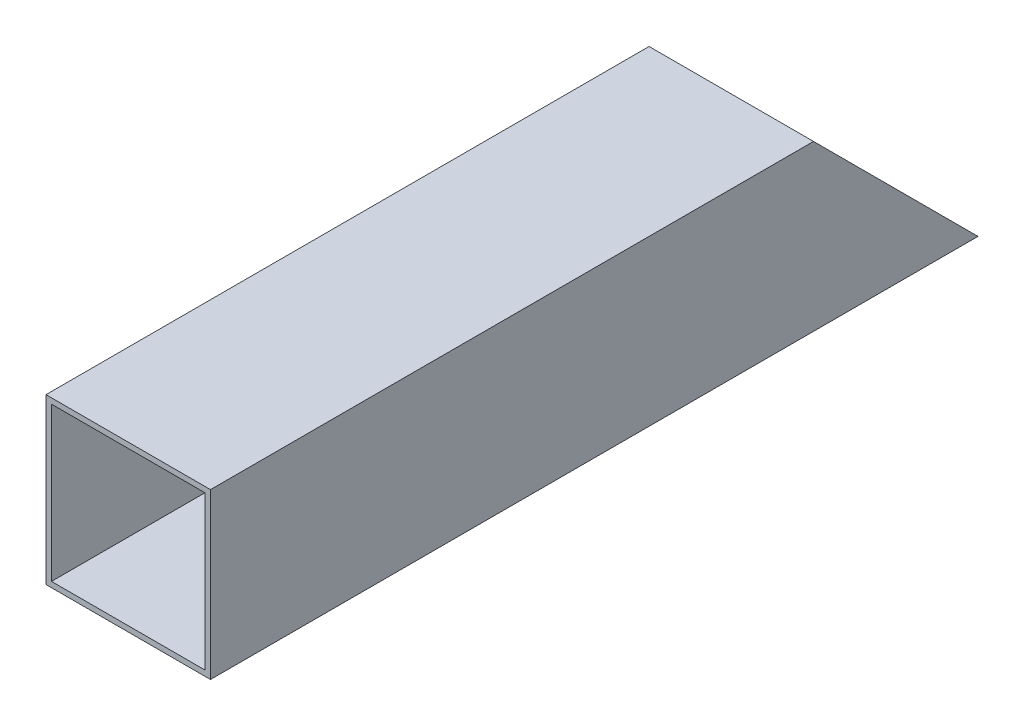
ISO-10303-21;
HEADER;
FILE_DESCRIPTION(('STEP AP214'),'2;1');
FILE_NAME('part.step','',(''),(''),'','','');
FILE_SCHEMA(('AUTOMOTIVE_DESIGN { 1 0 10303 214 1 1 1 1 }'));
ENDSEC;
DATA;
#1=APPLICATION_CONTEXT('core data for automotive mechanical design processes');
#2=APPLICATION_PROTOCOL_DEFINITION('international standard','automotive_design',2000,#1);
#3=PRODUCT_CONTEXT('',#1,'mechanical');
#4=PRODUCT('Part','Part','',(#3));
#5=PRODUCT_RELATED_PRODUCT_CATEGORY('part','',(#4));
#6=PRODUCT_DEFINITION_FORMATION('','',#4);
#7=PRODUCT_DEFINITION_CONTEXT('part definition',#1,'design');
#8=PRODUCT_DEFINITION('design','',#6,#7);
#9=PRODUCT_DEFINITION_SHAPE('','',#8);
#10=(LENGTH_UNIT() NAMED_UNIT(*) SI_UNIT(.MILLI.,.METRE.));
#11=(NAMED_UNIT(*) PLANE_ANGLE_UNIT() SI_UNIT($,.RADIAN.));
#12=(NAMED_UNIT(*) SI_UNIT($,.STERADIAN.) SOLID_ANGLE_UNIT());
#13=UNCERTAINTY_MEASURE_WITH_UNIT(LENGTH_MEASURE(1.E-05),#10,'distance_accuracy_value','');
#14=(GEOMETRIC_REPRESENTATION_CONTEXT(3) GLOBAL_UNCERTAINTY_ASSIGNED_CONTEXT((#13)) GLOBAL_UNIT_ASSIGNED_CONTEXT((#10,
#11,#12)) REPRESENTATION_CONTEXT('',''));
#15=CARTESIAN_POINT('',(0.,0.,0.));
#16=DIRECTION('',(0.,0.,1.));
#17=DIRECTION('',(1.,0.,0.));
#18=AXIS2_PLACEMENT_3D('',#15,#16,#17);
#19=CARTESIAN_POINT('',(0.,2.77555756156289E-13,140.));
#20=DIRECTION('',(0.,0.,1.));
#21=DIRECTION('',(0.999999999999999,0.,0.));
#22=AXIS2_PLACEMENT_3D('',#19,#20,#21);
#23=PLANE('',#22);
#24=DIRECTION('',(0.,1.,0.));
#25=VECTOR('',#24,1.);
#26=CARTESIAN_POINT('',(14.9999999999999,-14.9999999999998,140.));
#27=LINE('',#26,#25);
#28=CARTESIAN_POINT('',(14.9999999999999,-14.9999999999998,140.));
#29=VERTEX_POINT('',#28);
#30=CARTESIAN_POINT('',(15.,15.0000000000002,140.));
#31=VERTEX_POINT('',#30);
#32=EDGE_CURVE('E156',#29,#31,#27,.T.);
#33=ORIENTED_EDGE('',*,*,#32,.T.);
#34=DIRECTION('',(-0.999999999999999,0.,0.));
#35=VECTOR('',#34,1.);
#36=CARTESIAN_POINT('',(-15.,14.9999999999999,140.));
#37=LINE('',#36,#35);
#38=CARTESIAN_POINT('',(-15.,14.9999999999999,140.));
#39=VERTEX_POINT('',#38);
#40=EDGE_CURVE('E159',#31,#39,#37,.T.);
#41=ORIENTED_EDGE('',*,*,#40,.T.);
#42=DIRECTION('',(0.,-1.,0.));
#43=VECTOR('',#42,1.);
#44=CARTESIAN_POINT('',(-15.,-14.9999999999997,140.));
#45=LINE('',#44,#43);
#46=CARTESIAN_POINT('',(-15.,-14.9999999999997,140.));
#47=VERTEX_POINT('',#46);
#48=EDGE_CURVE('E161',#39,#47,#45,.T.);
#49=ORIENTED_EDGE('',*,*,#48,.T.);
#50=DIRECTION('',(0.999999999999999,0.,0.));
#51=VECTOR('',#50,1.);
#52=CARTESIAN_POINT('',(-15.,-14.9999999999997,140.));
#53=LINE('',#52,#51);
#54=EDGE_CURVE('E163',#47,#29,#53,.T.);
#55=ORIENTED_EDGE('',*,*,#54,.T.);
#56=EDGE_LOOP('',(#33,#41,#49,#55));
#57=FACE_BOUND('',#56,.T.);
#58=DIRECTION('',(-0.999999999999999,0.,0.));
#59=VECTOR('',#58,1.);
#60=CARTESIAN_POINT('',(0.,13.9999999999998,140.));
#61=LINE('',#60,#59);
#62=CARTESIAN_POINT('',(14.,14.0000000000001,140.));
#63=VERTEX_POINT('',#62);
#64=CARTESIAN_POINT('',(-14.,14.,140.));
#65=VERTEX_POINT('',#64);
#66=EDGE_CURVE('E193',#63,#65,#61,.T.);
#67=ORIENTED_EDGE('',*,*,#66,.F.);
#68=DIRECTION('',(0.,1.,0.));
#69=VECTOR('',#68,1.);
#70=CARTESIAN_POINT('',(14.,0.,140.));
#71=LINE('',#70,#69);
#72=CARTESIAN_POINT('',(14.,-14.0000000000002,140.));
#73=VERTEX_POINT('',#72);
#74=EDGE_CURVE('E191',#73,#63,#71,.T.);
#75=ORIENTED_EDGE('',*,*,#74,.F.);
#76=DIRECTION('',(0.999999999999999,0.,0.));
#77=VECTOR('',#76,1.);
#78=CARTESIAN_POINT('',(0.,-14.0000000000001,140.));
#79=LINE('',#78,#77);
#80=CARTESIAN_POINT('',(-14.,-14.,140.));
#81=VERTEX_POINT('',#80);
#82=EDGE_CURVE('E144',#81,#73,#79,.T.);
#83=ORIENTED_EDGE('',*,*,#82,.F.);
#84=DIRECTION('',(0.,-1.,0.));
#85=VECTOR('',#84,1.);
#86=CARTESIAN_POINT('',(-14.,-1.11022302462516E-13,140.));
#87=LINE('',#86,#85);
#88=EDGE_CURVE('E148',#65,#81,#87,.T.);
#89=ORIENTED_EDGE('',*,*,#88,.F.);
#90=EDGE_LOOP('',(#67,#75,#83,#89));
#91=FACE_BOUND('',#90,.T.);
#92=ADVANCED_FACE('F60',(#57,#91),#23,.T.);
#93=CARTESIAN_POINT('',(14.9999999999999,-14.9999999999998,140.));
#94=DIRECTION('',(-0.999999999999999,0.,0.));
#95=DIRECTION('',(0.,0.,1.));
#96=AXIS2_PLACEMENT_3D('',#93,#94,#95);
#97=PLANE('',#96);
#98=DIRECTION('',(0.,0.,-1.));
#99=VECTOR('',#98,1.);
#100=CARTESIAN_POINT('',(14.9999999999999,-14.9999999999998,140.));
#101=LINE('',#100,#99);
#102=CARTESIAN_POINT('',(15.,-15.0000000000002,0.));
#103=VERTEX_POINT('',#102);
#104=EDGE_CURVE('E165',#29,#103,#101,.T.);
#105=ORIENTED_EDGE('',*,*,#104,.T.);
#106=DIRECTION('',(0.,-0.707106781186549,-0.707106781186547));
#107=VECTOR('',#106,1.);
#108=CARTESIAN_POINT('',(15.,-15.0000000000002,0.));
#109=LINE('',#108,#107);
#110=CARTESIAN_POINT('',(15.,14.9999999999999,30.));
#111=VERTEX_POINT('',#110);
#112=EDGE_CURVE('E139',#111,#103,#109,.T.);
#113=ORIENTED_EDGE('',*,*,#112,.F.);
#114=DIRECTION('',(0.,0.,-1.));
#115=VECTOR('',#114,1.);
#116=CARTESIAN_POINT('',(15.,15.0000000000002,140.));
#117=LINE('',#116,#115);
#118=EDGE_CURVE('E12',#31,#111,#117,.T.);
#119=ORIENTED_EDGE('',*,*,#118,.F.);
#120=ORIENTED_EDGE('',*,*,#32,.F.);
#121=EDGE_LOOP('',(#105,#113,#119,#120));
#122=FACE_BOUND('',#121,.T.);
#123=ADVANCED_FACE('F62',(#122),#97,.F.);
#124=CARTESIAN_POINT('',(-15.,14.9999999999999,140.));
#125=DIRECTION('',(0.,-1.,0.));
#126=DIRECTION('',(0.,0.,-1.));
#127=AXIS2_PLACEMENT_3D('',#124,#125,#126);
#128=PLANE('',#127);
#129=ORIENTED_EDGE('',*,*,#118,.T.);
#130=DIRECTION('',(-0.999999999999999,0.,0.));
#131=VECTOR('',#130,1.);
#132=CARTESIAN_POINT('',(15.001,14.9999999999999,29.9999999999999));
#133=LINE('',#132,#131);
#134=CARTESIAN_POINT('',(-15.,14.9999999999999,30.));
#135=VERTEX_POINT('',#134);
#136=EDGE_CURVE('E129',#111,#135,#133,.T.);
#137=ORIENTED_EDGE('',*,*,#136,.T.);
#138=DIRECTION('',(0.,0.,-1.));
#139=VECTOR('',#138,1.);
#140=CARTESIAN_POINT('',(-15.,14.9999999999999,140.));
#141=LINE('',#140,#139);
#142=EDGE_CURVE('E68',#39,#135,#141,.T.);
#143=ORIENTED_EDGE('',*,*,#142,.F.);
#144=ORIENTED_EDGE('',*,*,#40,.F.);
#145=EDGE_LOOP('',(#129,#137,#143,#144));
#146=FACE_BOUND('',#145,.T.);
#147=ADVANCED_FACE('F182',(#146),#128,.F.);
#148=CARTESIAN_POINT('',(-15.,-14.9999999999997,140.));
#149=DIRECTION('',(0.999999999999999,0.,0.));
#150=DIRECTION('',(0.,0.,-1.));
#151=AXIS2_PLACEMENT_3D('',#148,#149,#150);
#152=PLANE('',#151);
#153=ORIENTED_EDGE('',*,*,#142,.T.);
#154=DIRECTION('',(0.,0.707106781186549,0.707106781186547));
#155=VECTOR('',#154,1.);
#156=CARTESIAN_POINT('',(-15.,-15.0000000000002,0.));
#157=LINE('',#156,#155);
#158=CARTESIAN_POINT('',(-15.,-15.0000000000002,0.));
#159=VERTEX_POINT('',#158);
#160=EDGE_CURVE('E179',#159,#135,#157,.T.);
#161=ORIENTED_EDGE('',*,*,#160,.F.);
#162=DIRECTION('',(0.,0.,-1.));
#163=VECTOR('',#162,1.);
#164=CARTESIAN_POINT('',(-15.,-14.9999999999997,140.));
#165=LINE('',#164,#163);
#166=EDGE_CURVE('E170',#47,#159,#165,.T.);
#167=ORIENTED_EDGE('',*,*,#166,.F.);
#168=ORIENTED_EDGE('',*,*,#48,.F.);
#169=EDGE_LOOP('',(#153,#161,#167,#168));
#170=FACE_BOUND('',#169,.T.);
#171=ADVANCED_FACE('F177',(#170),#152,.F.);
#172=CARTESIAN_POINT('',(-15.,-14.9999999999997,140.));
#173=DIRECTION('',(0.,1.,0.));
#174=DIRECTION('',(0.,0.,1.));
#175=AXIS2_PLACEMENT_3D('',#172,#173,#174);
#176=PLANE('',#175);
#177=DIRECTION('',(0.999999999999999,0.,0.));
#178=VECTOR('',#177,1.);
#179=CARTESIAN_POINT('',(-15.,-15.0000000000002,0.));
#180=LINE('',#179,#178);
#181=EDGE_CURVE('E155',#159,#103,#180,.T.);
#182=ORIENTED_EDGE('',*,*,#181,.T.);
#183=ORIENTED_EDGE('',*,*,#104,.F.);
#184=ORIENTED_EDGE('',*,*,#54,.F.);
#185=ORIENTED_EDGE('',*,*,#166,.T.);
#186=EDGE_LOOP('',(#182,#183,#184,#185));
#187=FACE_BOUND('',#186,.T.);
#188=ADVANCED_FACE('F209',(#187),#176,.F.);
#189=CARTESIAN_POINT('',(14.,0.,140.));
#190=DIRECTION('',(-0.999999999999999,0.,0.));
#191=DIRECTION('',(0.,0.,1.));
#192=AXIS2_PLACEMENT_3D('',#189,#190,#191);
#193=PLANE('',#192);
#194=DIRECTION('',(0.,-0.707106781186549,-0.707106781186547));
#195=VECTOR('',#194,1.);
#196=CARTESIAN_POINT('',(14.,-15.0000000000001,1.11022302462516E-13));
#197=LINE('',#196,#195);
#198=CARTESIAN_POINT('',(13.9999999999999,14.0000000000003,29.));
#199=VERTEX_POINT('',#198);
#200=CARTESIAN_POINT('',(14.,-13.9999999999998,1.));
#201=VERTEX_POINT('',#200);
#202=EDGE_CURVE('E126',#199,#201,#197,.T.);
#203=ORIENTED_EDGE('',*,*,#202,.T.);
#204=DIRECTION('',(0.,0.,-1.));
#205=VECTOR('',#204,1.);
#206=CARTESIAN_POINT('',(14.,-14.0000000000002,140.));
#207=LINE('',#206,#205);
#208=EDGE_CURVE('E135',#73,#201,#207,.T.);
#209=ORIENTED_EDGE('',*,*,#208,.F.);
#210=ORIENTED_EDGE('',*,*,#74,.T.);
#211=DIRECTION('',(0.,0.,-1.));
#212=VECTOR('',#211,1.);
#213=CARTESIAN_POINT('',(14.,14.0000000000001,140.));
#214=LINE('',#213,#212);
#215=EDGE_CURVE('E138',#63,#199,#214,.T.);
#216=ORIENTED_EDGE('',*,*,#215,.T.);
#217=EDGE_LOOP('',(#203,#209,#210,#216));
#218=FACE_BOUND('',#217,.T.);
#219=ADVANCED_FACE('F134',(#218),#193,.T.);
#220=CARTESIAN_POINT('',(0.,13.9999999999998,140.));
#221=DIRECTION('',(0.,-1.,0.));
#222=DIRECTION('',(0.,0.,-1.));
#223=AXIS2_PLACEMENT_3D('',#220,#221,#222);
#224=PLANE('',#223);
#225=DIRECTION('',(0.999999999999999,0.,0.));
#226=VECTOR('',#225,1.);
#227=CARTESIAN_POINT('',(15.001,13.9999999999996,29.));
#228=LINE('',#227,#226);
#229=CARTESIAN_POINT('',(-14.,14.,28.9999999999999));
#230=VERTEX_POINT('',#229);
#231=EDGE_CURVE('E140',#230,#199,#228,.T.);
#232=ORIENTED_EDGE('',*,*,#231,.T.);
#233=ORIENTED_EDGE('',*,*,#215,.F.);
#234=ORIENTED_EDGE('',*,*,#66,.T.);
#235=DIRECTION('',(0.,0.,-1.));
#236=VECTOR('',#235,1.);
#237=CARTESIAN_POINT('',(-14.,14.,140.));
#238=LINE('',#237,#236);
#239=EDGE_CURVE('E146',#65,#230,#238,.T.);
#240=ORIENTED_EDGE('',*,*,#239,.T.);
#241=EDGE_LOOP('',(#232,#233,#234,#240));
#242=FACE_BOUND('',#241,.T.);
#243=ADVANCED_FACE('F201',(#242),#224,.T.);
#244=CARTESIAN_POINT('',(-14.,-1.11022302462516E-13,140.));
#245=DIRECTION('',(0.999999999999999,0.,0.));
#246=DIRECTION('',(0.,0.,-1.));
#247=AXIS2_PLACEMENT_3D('',#244,#245,#246);
#248=PLANE('',#247);
#249=DIRECTION('',(0.,0.707106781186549,0.707106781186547));
#250=VECTOR('',#249,1.);
#251=CARTESIAN_POINT('',(-14.,-15.,0.));
#252=LINE('',#251,#250);
#253=CARTESIAN_POINT('',(-14.,-14.,1.00000000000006));
#254=VERTEX_POINT('',#253);
#255=EDGE_CURVE('E75',#254,#230,#252,.T.);
#256=ORIENTED_EDGE('',*,*,#255,.T.);
#257=ORIENTED_EDGE('',*,*,#239,.F.);
#258=ORIENTED_EDGE('',*,*,#88,.T.);
#259=DIRECTION('',(0.,0.,-1.));
#260=VECTOR('',#259,1.);
#261=CARTESIAN_POINT('',(-14.,-14.,140.));
#262=LINE('',#261,#260);
#263=EDGE_CURVE('E82',#81,#254,#262,.T.);
#264=ORIENTED_EDGE('',*,*,#263,.T.);
#265=EDGE_LOOP('',(#256,#257,#258,#264));
#266=FACE_BOUND('',#265,.T.);
#267=ADVANCED_FACE('F197',(#266),#248,.T.);
#268=CARTESIAN_POINT('',(0.,-14.0000000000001,140.));
#269=DIRECTION('',(0.,1.,0.));
#270=DIRECTION('',(0.,0.,1.));
#271=AXIS2_PLACEMENT_3D('',#268,#269,#270);
#272=PLANE('',#271);
#273=DIRECTION('',(-0.999999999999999,0.,0.));
#274=VECTOR('',#273,1.);
#275=CARTESIAN_POINT('',(15.001,-14.0000000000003,1.));
#276=LINE('',#275,#274);
#277=EDGE_CURVE('E122',#201,#254,#276,.T.);
#278=ORIENTED_EDGE('',*,*,#277,.T.);
#279=ORIENTED_EDGE('',*,*,#263,.F.);
#280=ORIENTED_EDGE('',*,*,#82,.T.);
#281=ORIENTED_EDGE('',*,*,#208,.T.);
#282=EDGE_LOOP('',(#278,#279,#280,#281));
#283=FACE_BOUND('',#282,.T.);
#284=ADVANCED_FACE('F142',(#283),#272,.T.);
#285=CARTESIAN_POINT('',(15.001,-14.9999999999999,0.));
#286=DIRECTION('',(0.,-0.707106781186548,0.707106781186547));
#287=DIRECTION('',(0.,-0.707106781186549,-0.707106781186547));
#288=AXIS2_PLACEMENT_3D('',#285,#286,#287);
#289=PLANE('',#288);
#290=ORIENTED_EDGE('',*,*,#231,.F.);
#291=ORIENTED_EDGE('',*,*,#255,.F.);
#292=ORIENTED_EDGE('',*,*,#277,.F.);
#293=ORIENTED_EDGE('',*,*,#202,.F.);
#294=EDGE_LOOP('',(#290,#291,#292,#293));
#295=FACE_BOUND('',#294,.T.);
#296=ORIENTED_EDGE('',*,*,#112,.T.);
#297=ORIENTED_EDGE('',*,*,#181,.F.);
#298=ORIENTED_EDGE('',*,*,#160,.T.);
#299=ORIENTED_EDGE('',*,*,#136,.F.);
#300=EDGE_LOOP('',(#296,#297,#298,#299));
#301=FACE_BOUND('',#300,.T.);
#302=ADVANCED_FACE('F124',(#295,#301),#289,.F.);
#303=CLOSED_SHELL('',(#92,#123,#147,#171,#188,#219,#243,#267,#284,#302));
#304=MANIFOLD_SOLID_BREP('B2',#303);
#305=ADVANCED_BREP_SHAPE_REPRESENTATION('',(#18,#304),#14);
#306=SHAPE_DEFINITION_REPRESENTATION(#9,#305);
ENDSEC;
END-ISO-10303-21;
